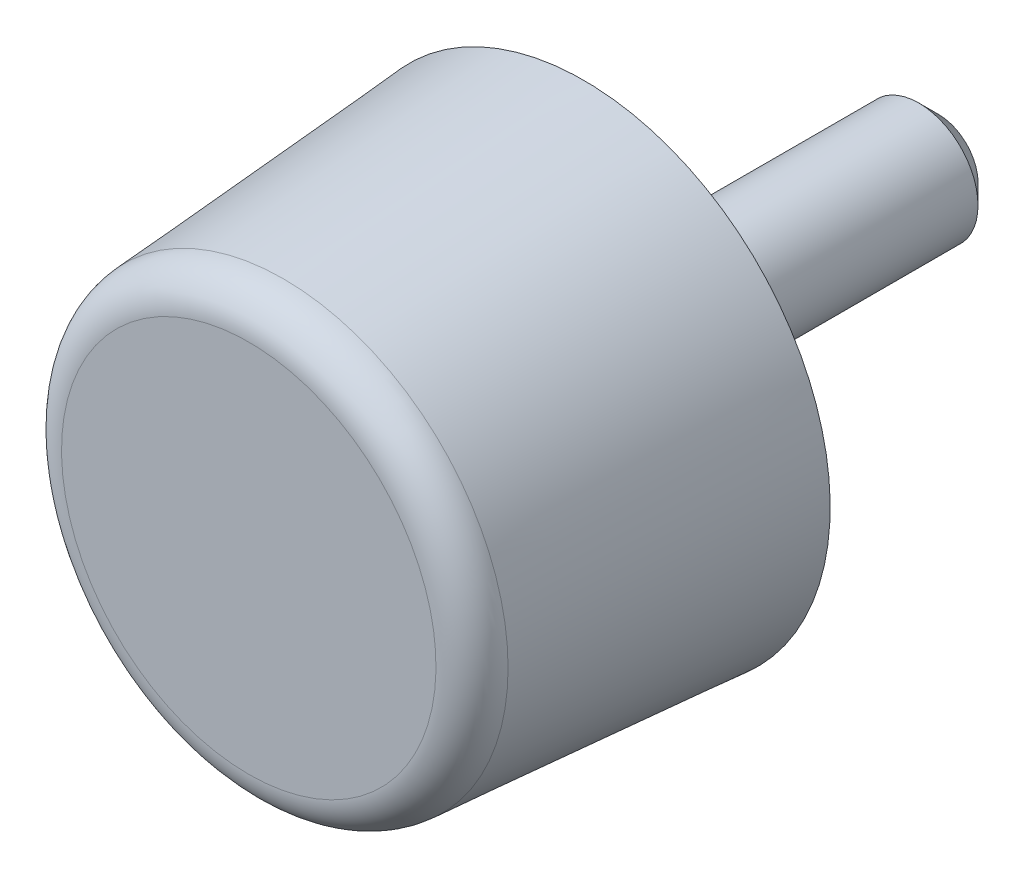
ISO-10303-21;
HEADER;
FILE_DESCRIPTION(('STEP AP214'),'2;1');
FILE_NAME('part.step','',(''),(''),'','','');
FILE_SCHEMA(('AUTOMOTIVE_DESIGN { 1 0 10303 214 1 1 1 1 }'));
ENDSEC;
DATA;
#1=APPLICATION_CONTEXT('core data for automotive mechanical design processes');
#2=APPLICATION_PROTOCOL_DEFINITION('international standard','automotive_design',2000,#1);
#3=PRODUCT_CONTEXT('',#1,'mechanical');
#4=PRODUCT('Part','Part','',(#3));
#5=PRODUCT_RELATED_PRODUCT_CATEGORY('part','',(#4));
#6=PRODUCT_DEFINITION_FORMATION('','',#4);
#7=PRODUCT_DEFINITION_CONTEXT('part definition',#1,'design');
#8=PRODUCT_DEFINITION('design','',#6,#7);
#9=PRODUCT_DEFINITION_SHAPE('','',#8);
#10=(LENGTH_UNIT() NAMED_UNIT(*) SI_UNIT(.MILLI.,.METRE.));
#11=(NAMED_UNIT(*) PLANE_ANGLE_UNIT() SI_UNIT($,.RADIAN.));
#12=(NAMED_UNIT(*) SI_UNIT($,.STERADIAN.) SOLID_ANGLE_UNIT());
#13=UNCERTAINTY_MEASURE_WITH_UNIT(LENGTH_MEASURE(1.E-05),#10,'distance_accuracy_value','');
#14=(GEOMETRIC_REPRESENTATION_CONTEXT(3) GLOBAL_UNCERTAINTY_ASSIGNED_CONTEXT((#13)) GLOBAL_UNIT_ASSIGNED_CONTEXT((#10,
#11,#12)) REPRESENTATION_CONTEXT('',''));
#15=CARTESIAN_POINT('',(0.,0.,0.));
#16=DIRECTION('',(0.,0.,1.));
#17=DIRECTION('',(1.,0.,0.));
#18=AXIS2_PLACEMENT_3D('',#15,#16,#17);
#19=CARTESIAN_POINT('',(0.,0.,17.));
#20=DIRECTION('',(0.,0.,1.));
#21=DIRECTION('',(0.,-1.,0.));
#22=AXIS2_PLACEMENT_3D('',#19,#20,#21);
#23=CYLINDRICAL_SURFACE('',#22,11.25);
#24=CARTESIAN_POINT('',(0.,0.,0.));
#25=DIRECTION('',(0.,0.,1.));
#26=DIRECTION('',(0.,-1.,0.));
#27=AXIS2_PLACEMENT_3D('',#24,#25,#26);
#28=CIRCLE('',#27,11.25);
#29=CARTESIAN_POINT('',(0.,-11.25,0.));
#30=VERTEX_POINT('',#29);
#31=EDGE_CURVE('E27',#30,#30,#28,.T.);
#32=ORIENTED_EDGE('',*,*,#31,.F.);
#33=EDGE_LOOP('',(#32));
#34=FACE_BOUND('',#33,.T.);
#35=CARTESIAN_POINT('',(0.,0.,0.0500000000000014));
#36=DIRECTION('',(0.,0.,1.));
#37=DIRECTION('',(0.,-1.,0.));
#38=AXIS2_PLACEMENT_3D('',#35,#36,#37);
#39=CIRCLE('',#38,11.25);
#40=CARTESIAN_POINT('',(0.,-11.25,0.0500000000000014));
#41=VERTEX_POINT('',#40);
#42=EDGE_CURVE('E44',#41,#41,#39,.T.);
#43=ORIENTED_EDGE('',*,*,#42,.T.);
#44=EDGE_LOOP('',(#43));
#45=FACE_BOUND('',#44,.T.);
#46=ADVANCED_FACE('F12',(#34,#45),#23,.F.);
#47=CARTESIAN_POINT('',(11.25,0.,0.));
#48=DIRECTION('',(0.,0.,1.));
#49=DIRECTION('',(0.,-1.,0.));
#50=AXIS2_PLACEMENT_3D('',#47,#48,#49);
#51=PLANE('',#50);
#52=CARTESIAN_POINT('',(0.,0.,0.));
#53=DIRECTION('',(0.,0.,1.));
#54=DIRECTION('',(0.,-1.,0.));
#55=AXIS2_PLACEMENT_3D('',#52,#53,#54);
#56=CIRCLE('',#55,12.5);
#57=CARTESIAN_POINT('',(0.,-12.5,0.));
#58=VERTEX_POINT('',#57);
#59=EDGE_CURVE('E32',#58,#58,#56,.T.);
#60=ORIENTED_EDGE('',*,*,#59,.F.);
#61=EDGE_LOOP('',(#60));
#62=FACE_BOUND('',#61,.T.);
#63=ORIENTED_EDGE('',*,*,#31,.T.);
#64=EDGE_LOOP('',(#63));
#65=FACE_BOUND('',#64,.T.);
#66=ADVANCED_FACE('F72',(#62,#65),#51,.F.);
#67=CARTESIAN_POINT('',(0.,0.,0.));
#68=DIRECTION('',(0.,0.,-1.));
#69=DIRECTION('',(0.,1.,0.));
#70=AXIS2_PLACEMENT_3D('',#67,#68,#69);
#71=CONICAL_SURFACE('',#70,12.5,0.0723905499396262);
#72=CARTESIAN_POINT('',(0.,0.,15.2374219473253));
#73=DIRECTION('',(0.,0.,1.));
#74=DIRECTION('',(0.,-1.,0.));
#75=AXIS2_PLACEMENT_3D('',#72,#73,#74);
#76=CIRCLE('',#75,11.3950238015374);
#77=CARTESIAN_POINT('',(0.,-11.3950238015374,15.2374219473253));
#78=VERTEX_POINT('',#77);
#79=EDGE_CURVE('E35',#78,#78,#76,.T.);
#80=ORIENTED_EDGE('',*,*,#79,.F.);
#81=EDGE_LOOP('',(#80));
#82=FACE_BOUND('',#81,.T.);
#83=ORIENTED_EDGE('',*,*,#59,.T.);
#84=EDGE_LOOP('',(#83));
#85=FACE_BOUND('',#84,.T.);
#86=ADVANCED_FACE('F77',(#82,#85),#71,.T.);
#87=CARTESIAN_POINT('',(0.,0.,15.1));
#88=DIRECTION('',(0.,0.,1.));
#89=DIRECTION('',(0.,-1.,0.));
#90=AXIS2_PLACEMENT_3D('',#87,#88,#89);
#91=TOROIDAL_SURFACE('',#90,9.5,1.9);
#92=ORIENTED_EDGE('',*,*,#79,.T.);
#93=EDGE_LOOP('',(#92));
#94=FACE_BOUND('',#93,.T.);
#95=CARTESIAN_POINT('',(0.,0.,17.));
#96=DIRECTION('',(0.,0.,1.));
#97=DIRECTION('',(0.,-1.,0.));
#98=AXIS2_PLACEMENT_3D('',#95,#96,#97);
#99=CIRCLE('',#98,9.5);
#100=CARTESIAN_POINT('',(0.,-9.5,17.));
#101=VERTEX_POINT('',#100);
#102=EDGE_CURVE('E38',#101,#101,#99,.T.);
#103=ORIENTED_EDGE('',*,*,#102,.F.);
#104=EDGE_LOOP('',(#103));
#105=FACE_BOUND('',#104,.T.);
#106=ADVANCED_FACE('F84',(#94,#105),#91,.T.);
#107=CARTESIAN_POINT('',(9.5,0.,17.));
#108=DIRECTION('',(0.,0.,-1.));
#109=DIRECTION('',(0.,1.,0.));
#110=AXIS2_PLACEMENT_3D('',#107,#108,#109);
#111=PLANE('',#110);
#112=ORIENTED_EDGE('',*,*,#102,.T.);
#113=EDGE_LOOP('',(#112));
#114=FACE_BOUND('',#113,.T.);
#115=ADVANCED_FACE('F59',(#114),#111,.F.);
#116=CARTESIAN_POINT('',(0.,0.,0.));
#117=DIRECTION('',(0.,0.,1.));
#118=DIRECTION('',(0.,-1.,0.));
#119=AXIS2_PLACEMENT_3D('',#116,#117,#118);
#120=PLANE('',#119);
#121=CARTESIAN_POINT('',(0.,0.,0.));
#122=DIRECTION('',(0.,0.,1.));
#123=DIRECTION('',(0.,-1.,0.));
#124=AXIS2_PLACEMENT_3D('',#121,#122,#123);
#125=CIRCLE('',#124,11.2);
#126=CARTESIAN_POINT('',(0.,-11.2,0.));
#127=VERTEX_POINT('',#126);
#128=EDGE_CURVE('E41',#127,#127,#125,.T.);
#129=ORIENTED_EDGE('',*,*,#128,.F.);
#130=EDGE_LOOP('',(#129));
#131=FACE_BOUND('',#130,.T.);
#132=CARTESIAN_POINT('',(0.,0.,0.));
#133=DIRECTION('',(0.,0.,1.));
#134=DIRECTION('',(0.,-1.,0.));
#135=AXIS2_PLACEMENT_3D('',#132,#133,#134);
#136=CIRCLE('',#135,3.);
#137=CARTESIAN_POINT('',(0.,-3.,0.));
#138=VERTEX_POINT('',#137);
#139=EDGE_CURVE('E23',#138,#138,#136,.T.);
#140=ORIENTED_EDGE('',*,*,#139,.T.);
#141=EDGE_LOOP('',(#140));
#142=FACE_BOUND('',#141,.T.);
#143=ADVANCED_FACE('F53',(#131,#142),#120,.F.);
#144=CARTESIAN_POINT('',(0.,0.,0.));
#145=DIRECTION('',(0.,0.,1.));
#146=DIRECTION('',(0.,-1.,0.));
#147=AXIS2_PLACEMENT_3D('',#144,#145,#146);
#148=CONICAL_SURFACE('',#147,11.2,0.785398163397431);
#149=ORIENTED_EDGE('',*,*,#42,.F.);
#150=EDGE_LOOP('',(#149));
#151=FACE_BOUND('',#150,.T.);
#152=ORIENTED_EDGE('',*,*,#128,.T.);
#153=EDGE_LOOP('',(#152));
#154=FACE_BOUND('',#153,.T.);
#155=ADVANCED_FACE('F49',(#151,#154),#148,.T.);
#156=CARTESIAN_POINT('',(0.,0.,17.));
#157=DIRECTION('',(0.,0.,1.));
#158=DIRECTION('',(0.,-1.,0.));
#159=AXIS2_PLACEMENT_3D('',#156,#157,#158);
#160=CYLINDRICAL_SURFACE('',#159,3.);
#161=CARTESIAN_POINT('',(0.,0.,-17.));
#162=DIRECTION('',(0.,0.,-1.));
#163=DIRECTION('',(0.,1.,0.));
#164=AXIS2_PLACEMENT_3D('',#161,#162,#163);
#165=CIRCLE('',#164,3.);
#166=CARTESIAN_POINT('',(0.,3.,-17.));
#167=VERTEX_POINT('',#166);
#168=EDGE_CURVE('E8',#167,#167,#165,.F.);
#169=ORIENTED_EDGE('',*,*,#168,.T.);
#170=EDGE_LOOP('',(#169));
#171=FACE_BOUND('',#170,.T.);
#172=ORIENTED_EDGE('',*,*,#139,.F.);
#173=EDGE_LOOP('',(#172));
#174=FACE_BOUND('',#173,.T.);
#175=ADVANCED_FACE('F52',(#171,#174),#160,.T.);
#176=CARTESIAN_POINT('',(0.,0.,-18.));
#177=DIRECTION('',(0.,0.,-1.));
#178=DIRECTION('',(0.,1.,0.));
#179=AXIS2_PLACEMENT_3D('',#176,#177,#178);
#180=PLANE('',#179);
#181=CARTESIAN_POINT('',(0.,0.,-18.));
#182=DIRECTION('',(0.,0.,-1.));
#183=DIRECTION('',(0.,1.,0.));
#184=AXIS2_PLACEMENT_3D('',#181,#182,#183);
#185=CIRCLE('',#184,2.);
#186=CARTESIAN_POINT('',(0.,2.,-18.));
#187=VERTEX_POINT('',#186);
#188=EDGE_CURVE('E19',#187,#187,#185,.T.);
#189=ORIENTED_EDGE('',*,*,#188,.T.);
#190=EDGE_LOOP('',(#189));
#191=FACE_BOUND('',#190,.T.);
#192=ADVANCED_FACE('F64',(#191),#180,.T.);
#193=CARTESIAN_POINT('',(0.,0.,-18.));
#194=DIRECTION('',(0.,0.,1.));
#195=DIRECTION('',(0.,-1.,0.));
#196=AXIS2_PLACEMENT_3D('',#193,#194,#195);
#197=CONICAL_SURFACE('',#196,2.,0.785398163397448);
#198=ORIENTED_EDGE('',*,*,#168,.F.);
#199=EDGE_LOOP('',(#198));
#200=FACE_BOUND('',#199,.T.);
#201=ORIENTED_EDGE('',*,*,#188,.F.);
#202=EDGE_LOOP('',(#201));
#203=FACE_BOUND('',#202,.T.);
#204=ADVANCED_FACE('F14',(#200,#203),#197,.T.);
#205=CLOSED_SHELL('',(#46,#66,#86,#106,#115,#143,#155,#175,#192,#204));
#206=MANIFOLD_SOLID_BREP('B1',#205);
#207=ADVANCED_BREP_SHAPE_REPRESENTATION('',(#18,#206),#14);
#208=SHAPE_DEFINITION_REPRESENTATION(#9,#207);
ENDSEC;
END-ISO-10303-21;
